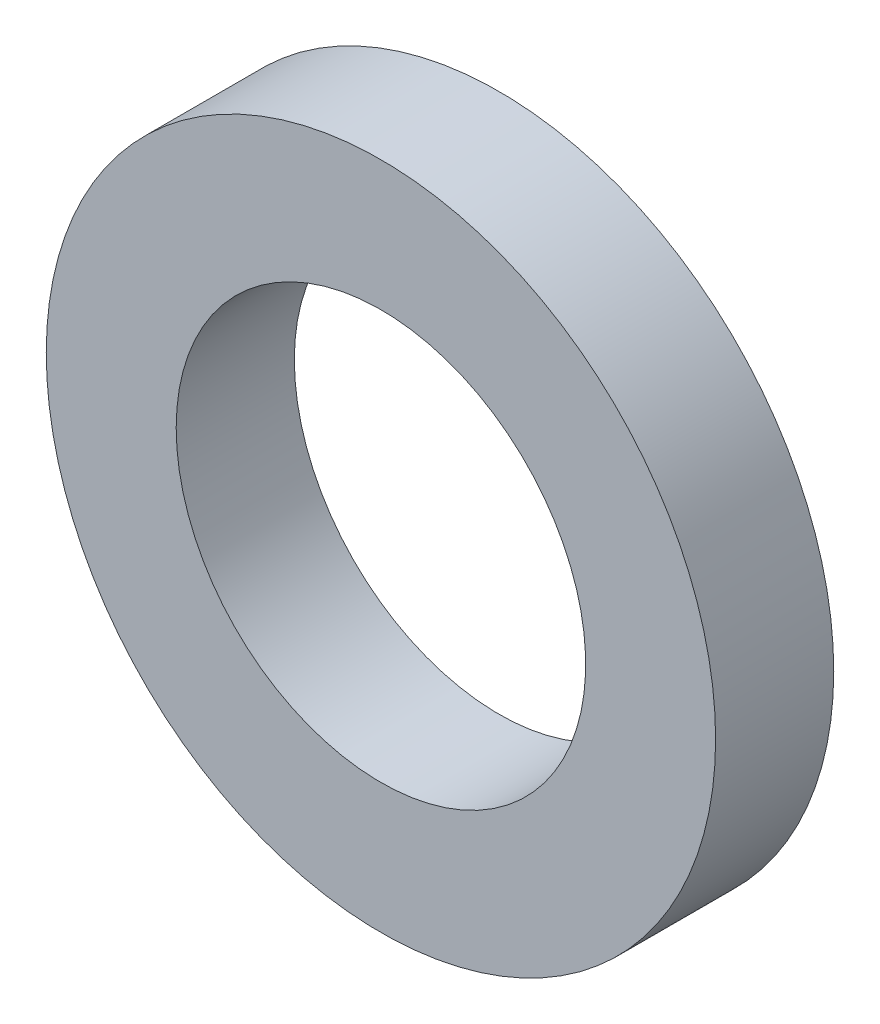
from build123d import *

# Parameters (mm, degrees)
ESQUISSE1_W = 1.5
ESQUISSE1_H = 1.65


with BuildPart() as part:
    # Esquisse1 → R_volution1 (revolve)
    with BuildSketch(Plane(origin=(0, 0, 0), x_dir=(0, 0, -1), z_dir=(1, 0, 0)), mode=Mode.PRIVATE) as r_volution1_sk:
        with Locations((0, 3.425)):
            Rectangle(ESQUISSE1_W, ESQUISSE1_H)
    revolve(r_volution1_sk.sketch.rotate(Axis((0, 0, 0), (0, 0, 1)), 90), axis=Axis((0, 0, 0), (0, 0, 1)))


solid = part.part
